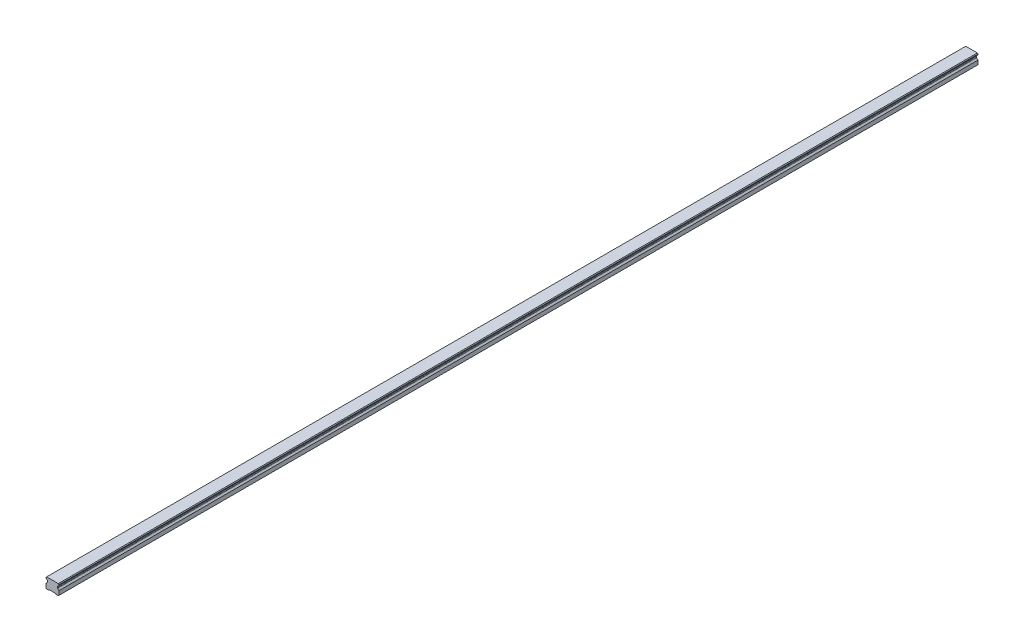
from build123d import *

# Parameters (mm, degrees)
SKETCH1_W           = 20
SKETCH1_H           = 16.3
BOSS_EXTRUDE1_DEPTH = 710
CUT_EXTRUDE1_DEPTH  = 1421.128758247
CHAMFER1_SIZE       = 1
FILLET1_R           = 1
CUT_EXTRUDE2_DEPTH  = 1421.128758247
SKETCH5_R           = 3
SKETCH5_R_2         = 2.5
CUT_EXTRUDE5_DEPTH  = 10
SKETCH5_2_R         = 2.5
CUT_EXTRUDE6_DEPTH  = 13
LPATTERN2_COUNT     = 24
LPATTERN2_PITCH     = 60


with BuildPart() as part:
    # Sketch1 → Boss-Extrude1 (new, symmetric)
    with BuildSketch(Plane.XY):
        with Locations((0, 8.15)):
            Rectangle(SKETCH1_W, SKETCH1_H)
    extrude(amount=BOSS_EXTRUDE1_DEPTH, both=True)

    # Sketch2 → Cut-Extrude1 (cut, through all)
    with BuildSketch(Plane.XY.offset(710)):
        Polygon((-10, 14.3), (-10, 7.3), (-7.666666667, 9.633333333), (-7.666666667, 11.966666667), align=None)
        Polygon((7.666666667, 11.966666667), (10, 14.3), (10, 7.3), (7.666666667, 9.633333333), align=None)
    extrude(amount=-CUT_EXTRUDE1_DEPTH, mode=Mode.SUBTRACT)

    # Chamfer1
    chamfer1_edges = [part.edges().sort_by_distance(p)[0] for p in [
        (-10, 16.3, 0),
        (10, 16.3, 0),
        (10, 0, 0),
        (-10, 0, 0),
    ]]
    chamfer(chamfer1_edges, length=CHAMFER1_SIZE)

    # Fillet1
    fillet1_edges = [part.edges().sort_by_distance(p)[0] for p in [
        (-7.666666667, 11.966666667, 0),
        (-7.666666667, 9.633333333, 0),
        (7.666666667, 9.633333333, 0),
        (7.666666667, 11.966666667, 0),
    ]]
    fillet(fillet1_edges, radius=FILLET1_R)

    # Sketch3 → Cut-Extrude2 (cut, through all)
    with BuildSketch(Plane.XY.offset(710)):
        Polygon((-6, 0), (-5, 1), (5, 1), (6, 0), align=None)
    extrude(amount=-CUT_EXTRUDE2_DEPTH, mode=Mode.SUBTRACT)

    # Sketch5 → Cut-Extrude5 (cut)
    with BuildSketch(Plane.XZ.offset(-1)):
        with Locations(Location((0, 690, 0), (0, 0, 270))):
            Circle(SKETCH5_R)
        with Locations(Location((0, 690, 0), (0, 0, 270))):
            Circle(SKETCH5_R_2, mode=Mode.SUBTRACT)
    cut_extrude5 = extrude(amount=-CUT_EXTRUDE5_DEPTH, mode=Mode.SUBTRACT)

    # Sketch5_2 → Cut-Extrude6 (cut)
    with BuildSketch(Plane.XZ.offset(-1)):
        with Locations(Location((0, 690, 0), (0, 0, 270))):
            Circle(SKETCH5_2_R)
    cut_extrude6 = extrude(amount=-CUT_EXTRUDE6_DEPTH, mode=Mode.SUBTRACT)

    # Cut-Extrude7 cone 1 section (on through the dimple's axis) → Cut-Extrude7 (revolve, cut)
    with BuildSketch(Plane(origin=(0, 14, 690), x_dir=(0, 0, -1), z_dir=(1, 0, 0))):
        Polygon((0, 0), (2.5, 0), (0, 1.443375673), align=None)
    cut_extrude7 = revolve(axis=Axis((0, 14, 690), (0, 1, 0)), mode=Mode.SUBTRACT)

    # LPattern2: Cut-Extrude5, Cut-Extrude6, Cut-Extrude7 ×24
    with Locations(*[(0, 0, -i * LPATTERN2_PITCH) for i in range(1, LPATTERN2_COUNT)]):
        add(cut_extrude5, mode=Mode.SUBTRACT)
        add(cut_extrude6, mode=Mode.SUBTRACT)
        add(cut_extrude7, mode=Mode.SUBTRACT)


solid = part.part
